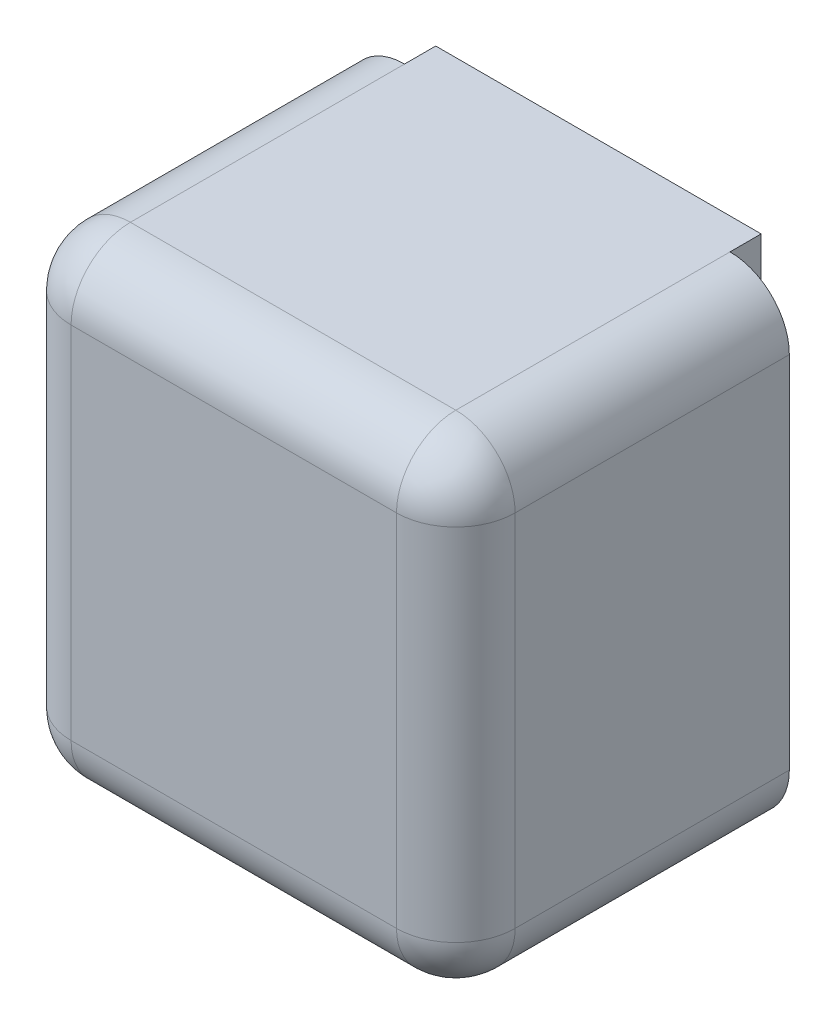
ISO-10303-21;
HEADER;
FILE_DESCRIPTION(('STEP AP214'),'2;1');
FILE_NAME('part.step','',(''),(''),'','','');
FILE_SCHEMA(('AUTOMOTIVE_DESIGN { 1 0 10303 214 1 1 1 1 }'));
ENDSEC;
DATA;
#1=APPLICATION_CONTEXT('core data for automotive mechanical design processes');
#2=APPLICATION_PROTOCOL_DEFINITION('international standard','automotive_design',2000,#1);
#3=PRODUCT_CONTEXT('',#1,'mechanical');
#4=PRODUCT('Part','Part','',(#3));
#5=PRODUCT_RELATED_PRODUCT_CATEGORY('part','',(#4));
#6=PRODUCT_DEFINITION_FORMATION('','',#4);
#7=PRODUCT_DEFINITION_CONTEXT('part definition',#1,'design');
#8=PRODUCT_DEFINITION('design','',#6,#7);
#9=PRODUCT_DEFINITION_SHAPE('','',#8);
#10=(LENGTH_UNIT() NAMED_UNIT(*) SI_UNIT(.MILLI.,.METRE.));
#11=(NAMED_UNIT(*) PLANE_ANGLE_UNIT() SI_UNIT($,.RADIAN.));
#12=(NAMED_UNIT(*) SI_UNIT($,.STERADIAN.) SOLID_ANGLE_UNIT());
#13=UNCERTAINTY_MEASURE_WITH_UNIT(LENGTH_MEASURE(1.E-05),#10,'distance_accuracy_value','');
#14=(GEOMETRIC_REPRESENTATION_CONTEXT(3) GLOBAL_UNCERTAINTY_ASSIGNED_CONTEXT((#13)) GLOBAL_UNIT_ASSIGNED_CONTEXT((#10,
#11,#12)) REPRESENTATION_CONTEXT('',''));
#15=CARTESIAN_POINT('',(0.,0.,0.));
#16=DIRECTION('',(0.,0.,1.));
#17=DIRECTION('',(1.,0.,0.));
#18=AXIS2_PLACEMENT_3D('',#15,#16,#17);
#19=CARTESIAN_POINT('',(-14.2621,-15.367,0.));
#20=DIRECTION('',(0.,0.,1.));
#21=DIRECTION('',(1.,0.,0.));
#22=AXIS2_PLACEMENT_3D('',#19,#20,#21);
#23=PLANE('',#22);
#24=DIRECTION('',(0.,1.,0.));
#25=VECTOR('',#24,1.);
#26=CARTESIAN_POINT('',(-10.4521,-11.049,0.));
#27=LINE('',#26,#25);
#28=CARTESIAN_POINT('',(-10.4521,-15.367,0.));
#29=VERTEX_POINT('',#28);
#30=CARTESIAN_POINT('',(-10.4521,-11.049,0.));
#31=VERTEX_POINT('',#30);
#32=EDGE_CURVE('E142',#29,#31,#27,.T.);
#33=ORIENTED_EDGE('',*,*,#32,.F.);
#34=CARTESIAN_POINT('',(-10.4521,-11.557,0.));
#35=DIRECTION('',(0.,0.,1.));
#36=DIRECTION('',(1.,0.,0.));
#37=AXIS2_PLACEMENT_3D('',#34,#35,#36);
#38=CIRCLE('',#37,3.81);
#39=CARTESIAN_POINT('',(-14.2621,-11.557,0.));
#40=VERTEX_POINT('',#39);
#41=EDGE_CURVE('E155',#29,#40,#38,.F.);
#42=ORIENTED_EDGE('',*,*,#41,.T.);
#43=DIRECTION('',(0.,-1.,0.));
#44=VECTOR('',#43,1.);
#45=CARTESIAN_POINT('',(-14.2621,15.367,0.));
#46=LINE('',#45,#44);
#47=CARTESIAN_POINT('',(-14.2621,11.557,0.));
#48=VERTEX_POINT('',#47);
#49=EDGE_CURVE('E234',#48,#40,#46,.T.);
#50=ORIENTED_EDGE('',*,*,#49,.F.);
#51=CARTESIAN_POINT('',(-10.4521,11.557,0.));
#52=DIRECTION('',(0.,0.,1.));
#53=DIRECTION('',(1.,0.,0.));
#54=AXIS2_PLACEMENT_3D('',#51,#52,#53);
#55=CIRCLE('',#54,3.81);
#56=CARTESIAN_POINT('',(-10.4521,15.367,0.));
#57=VERTEX_POINT('',#56);
#58=EDGE_CURVE('E169',#48,#57,#55,.F.);
#59=ORIENTED_EDGE('',*,*,#58,.T.);
#60=DIRECTION('',(0.,1.,0.));
#61=VECTOR('',#60,1.);
#62=CARTESIAN_POINT('',(-10.4521,15.367,0.));
#63=LINE('',#62,#61);
#64=CARTESIAN_POINT('',(-10.4521,11.049,0.));
#65=VERTEX_POINT('',#64);
#66=EDGE_CURVE('E233',#65,#57,#63,.T.);
#67=ORIENTED_EDGE('',*,*,#66,.F.);
#68=DIRECTION('',(-1.,0.,0.));
#69=VECTOR('',#68,1.);
#70=CARTESIAN_POINT('',(-10.4521,11.049,0.));
#71=LINE('',#70,#69);
#72=CARTESIAN_POINT('',(10.4521,11.049,0.));
#73=VERTEX_POINT('',#72);
#74=EDGE_CURVE('E41',#73,#65,#71,.T.);
#75=ORIENTED_EDGE('',*,*,#74,.F.);
#76=DIRECTION('',(0.,-1.,0.));
#77=VECTOR('',#76,1.);
#78=CARTESIAN_POINT('',(10.4521,11.049,0.));
#79=LINE('',#78,#77);
#80=CARTESIAN_POINT('',(10.4521,15.367,0.));
#81=VERTEX_POINT('',#80);
#82=EDGE_CURVE('E149',#81,#73,#79,.T.);
#83=ORIENTED_EDGE('',*,*,#82,.F.);
#84=CARTESIAN_POINT('',(10.4521,11.557,0.));
#85=DIRECTION('',(0.,0.,1.));
#86=DIRECTION('',(1.,0.,0.));
#87=AXIS2_PLACEMENT_3D('',#84,#85,#86);
#88=CIRCLE('',#87,3.81);
#89=CARTESIAN_POINT('',(14.2621,11.557,0.));
#90=VERTEX_POINT('',#89);
#91=EDGE_CURVE('E47',#81,#90,#88,.F.);
#92=ORIENTED_EDGE('',*,*,#91,.T.);
#93=DIRECTION('',(0.,1.,0.));
#94=VECTOR('',#93,1.);
#95=CARTESIAN_POINT('',(14.2621,15.367,0.));
#96=LINE('',#95,#94);
#97=CARTESIAN_POINT('',(14.2621,-11.557,0.));
#98=VERTEX_POINT('',#97);
#99=EDGE_CURVE('E236',#98,#90,#96,.T.);
#100=ORIENTED_EDGE('',*,*,#99,.F.);
#101=CARTESIAN_POINT('',(10.4521,-11.557,0.));
#102=DIRECTION('',(0.,0.,1.));
#103=DIRECTION('',(1.,0.,0.));
#104=AXIS2_PLACEMENT_3D('',#101,#102,#103);
#105=CIRCLE('',#104,3.81);
#106=CARTESIAN_POINT('',(10.4521,-15.367,0.));
#107=VERTEX_POINT('',#106);
#108=EDGE_CURVE('E176',#98,#107,#105,.F.);
#109=ORIENTED_EDGE('',*,*,#108,.T.);
#110=DIRECTION('',(0.,-1.,0.));
#111=VECTOR('',#110,1.);
#112=CARTESIAN_POINT('',(10.4521,-15.367,0.));
#113=LINE('',#112,#111);
#114=CARTESIAN_POINT('',(10.4521,-11.049,0.));
#115=VERTEX_POINT('',#114);
#116=EDGE_CURVE('E323',#115,#107,#113,.T.);
#117=ORIENTED_EDGE('',*,*,#116,.F.);
#118=DIRECTION('',(1.,0.,0.));
#119=VECTOR('',#118,1.);
#120=CARTESIAN_POINT('',(10.4521,-11.049,0.));
#121=LINE('',#120,#119);
#122=EDGE_CURVE('E158',#31,#115,#121,.T.);
#123=ORIENTED_EDGE('',*,*,#122,.F.);
#124=EDGE_LOOP('',(#33,#42,#50,#59,#67,#75,#83,#92,#100,#109,#117,#123));
#125=FACE_BOUND('',#124,.T.);
#126=ADVANCED_FACE('F26',(#125),#23,.F.);
#127=CARTESIAN_POINT('',(-14.2621,15.367,21.4249));
#128=DIRECTION('',(1.,0.,0.));
#129=DIRECTION('',(0.,0.,-1.));
#130=AXIS2_PLACEMENT_3D('',#127,#128,#129);
#131=PLANE('',#130);
#132=ORIENTED_EDGE('',*,*,#49,.T.);
#133=DIRECTION('',(0.,0.,-1.));
#134=VECTOR('',#133,1.);
#135=CARTESIAN_POINT('',(-14.2621,-11.557,21.4249));
#136=LINE('',#135,#134);
#137=CARTESIAN_POINT('',(-14.2621,-11.557,17.6149));
#138=VERTEX_POINT('',#137);
#139=EDGE_CURVE('E174',#40,#138,#136,.F.);
#140=ORIENTED_EDGE('',*,*,#139,.T.);
#141=DIRECTION('',(0.,-1.,0.));
#142=VECTOR('',#141,1.);
#143=CARTESIAN_POINT('',(-14.2621,15.367,17.6149));
#144=LINE('',#143,#142);
#145=CARTESIAN_POINT('',(-14.2621,11.557,17.6149));
#146=VERTEX_POINT('',#145);
#147=EDGE_CURVE('E258',#138,#146,#144,.F.);
#148=ORIENTED_EDGE('',*,*,#147,.T.);
#149=DIRECTION('',(0.,0.,-1.));
#150=VECTOR('',#149,1.);
#151=CARTESIAN_POINT('',(-14.2621,11.557,21.4249));
#152=LINE('',#151,#150);
#153=EDGE_CURVE('E175',#146,#48,#152,.T.);
#154=ORIENTED_EDGE('',*,*,#153,.T.);
#155=EDGE_LOOP('',(#132,#140,#148,#154));
#156=FACE_BOUND('',#155,.T.);
#157=ADVANCED_FACE('F28',(#156),#131,.F.);
#158=CARTESIAN_POINT('',(-14.2621,-15.367,21.4249));
#159=DIRECTION('',(0.,1.,0.));
#160=DIRECTION('',(0.,0.,1.));
#161=AXIS2_PLACEMENT_3D('',#158,#159,#160);
#162=PLANE('',#161);
#163=DIRECTION('',(1.,0.,0.));
#164=VECTOR('',#163,1.);
#165=CARTESIAN_POINT('',(-14.2621,-15.367,17.6149));
#166=LINE('',#165,#164);
#167=CARTESIAN_POINT('',(10.4521,-15.367,17.6149));
#168=VERTEX_POINT('',#167);
#169=CARTESIAN_POINT('',(-10.4521,-15.367,17.6149));
#170=VERTEX_POINT('',#169);
#171=EDGE_CURVE('E165',#168,#170,#166,.F.);
#172=ORIENTED_EDGE('',*,*,#171,.T.);
#173=DIRECTION('',(0.,0.,-1.));
#174=VECTOR('',#173,1.);
#175=CARTESIAN_POINT('',(-10.4521,-15.367,21.4249));
#176=LINE('',#175,#174);
#177=EDGE_CURVE('E162',#170,#29,#176,.T.);
#178=ORIENTED_EDGE('',*,*,#177,.T.);
#179=DIRECTION('',(0.,0.,1.));
#180=VECTOR('',#179,1.);
#181=CARTESIAN_POINT('',(-10.4521,-15.367,-2.));
#182=LINE('',#181,#180);
#183=CARTESIAN_POINT('',(-10.4521,-15.367,-2.));
#184=VERTEX_POINT('',#183);
#185=EDGE_CURVE('E138',#184,#29,#182,.T.);
#186=ORIENTED_EDGE('',*,*,#185,.F.);
#187=DIRECTION('',(-1.,0.,0.));
#188=VECTOR('',#187,1.);
#189=CARTESIAN_POINT('',(-10.4521,-15.367,-2.));
#190=LINE('',#189,#188);
#191=CARTESIAN_POINT('',(10.4521,-15.367,-2.));
#192=VERTEX_POINT('',#191);
#193=EDGE_CURVE('E503',#192,#184,#190,.T.);
#194=ORIENTED_EDGE('',*,*,#193,.F.);
#195=DIRECTION('',(0.,0.,1.));
#196=VECTOR('',#195,1.);
#197=CARTESIAN_POINT('',(10.4521,-15.367,-2.));
#198=LINE('',#197,#196);
#199=EDGE_CURVE('E325',#192,#107,#198,.T.);
#200=ORIENTED_EDGE('',*,*,#199,.T.);
#201=DIRECTION('',(0.,0.,-1.));
#202=VECTOR('',#201,1.);
#203=CARTESIAN_POINT('',(10.4521,-15.367,21.4249));
#204=LINE('',#203,#202);
#205=EDGE_CURVE('E170',#107,#168,#204,.F.);
#206=ORIENTED_EDGE('',*,*,#205,.T.);
#207=EDGE_LOOP('',(#172,#178,#186,#194,#200,#206));
#208=FACE_BOUND('',#207,.T.);
#209=ADVANCED_FACE('F163',(#208),#162,.F.);
#210=CARTESIAN_POINT('',(14.2621,15.367,21.4249));
#211=DIRECTION('',(-1.,0.,0.));
#212=DIRECTION('',(0.,0.,1.));
#213=AXIS2_PLACEMENT_3D('',#210,#211,#212);
#214=PLANE('',#213);
#215=DIRECTION('',(0.,1.,0.));
#216=VECTOR('',#215,1.);
#217=CARTESIAN_POINT('',(14.2621,-15.367,17.6149));
#218=LINE('',#217,#216);
#219=CARTESIAN_POINT('',(14.2621,11.557,17.6149));
#220=VERTEX_POINT('',#219);
#221=CARTESIAN_POINT('',(14.2621,-11.557,17.6149));
#222=VERTEX_POINT('',#221);
#223=EDGE_CURVE('E211',#220,#222,#218,.F.);
#224=ORIENTED_EDGE('',*,*,#223,.T.);
#225=DIRECTION('',(0.,0.,-1.));
#226=VECTOR('',#225,1.);
#227=CARTESIAN_POINT('',(14.2621,-11.557,21.4249));
#228=LINE('',#227,#226);
#229=EDGE_CURVE('E186',#222,#98,#228,.T.);
#230=ORIENTED_EDGE('',*,*,#229,.T.);
#231=ORIENTED_EDGE('',*,*,#99,.T.);
#232=DIRECTION('',(0.,0.,-1.));
#233=VECTOR('',#232,1.);
#234=CARTESIAN_POINT('',(14.2621,11.557,21.4249));
#235=LINE('',#234,#233);
#236=EDGE_CURVE('E184',#90,#220,#235,.F.);
#237=ORIENTED_EDGE('',*,*,#236,.T.);
#238=EDGE_LOOP('',(#224,#230,#231,#237));
#239=FACE_BOUND('',#238,.T.);
#240=ADVANCED_FACE('F321',(#239),#214,.F.);
#241=CARTESIAN_POINT('',(-14.2621,15.367,21.4249));
#242=DIRECTION('',(0.,-1.,0.));
#243=DIRECTION('',(0.,0.,-1.));
#244=AXIS2_PLACEMENT_3D('',#241,#242,#243);
#245=PLANE('',#244);
#246=DIRECTION('',(-1.,0.,0.));
#247=VECTOR('',#246,1.);
#248=CARTESIAN_POINT('',(14.2621,15.367,17.6149));
#249=LINE('',#248,#247);
#250=CARTESIAN_POINT('',(-10.4521,15.367,17.6149));
#251=VERTEX_POINT('',#250);
#252=CARTESIAN_POINT('',(10.4521,15.367,17.6149));
#253=VERTEX_POINT('',#252);
#254=EDGE_CURVE('E193',#251,#253,#249,.F.);
#255=ORIENTED_EDGE('',*,*,#254,.T.);
#256=DIRECTION('',(0.,0.,-1.));
#257=VECTOR('',#256,1.);
#258=CARTESIAN_POINT('',(10.4521,15.367,21.4249));
#259=LINE('',#258,#257);
#260=EDGE_CURVE('E11',#253,#81,#259,.T.);
#261=ORIENTED_EDGE('',*,*,#260,.T.);
#262=DIRECTION('',(0.,0.,1.));
#263=VECTOR('',#262,1.);
#264=CARTESIAN_POINT('',(10.4521,15.367,-2.));
#265=LINE('',#264,#263);
#266=CARTESIAN_POINT('',(10.4521,15.367,-2.));
#267=VERTEX_POINT('',#266);
#268=EDGE_CURVE('E287',#267,#81,#265,.T.);
#269=ORIENTED_EDGE('',*,*,#268,.F.);
#270=DIRECTION('',(1.,0.,0.));
#271=VECTOR('',#270,1.);
#272=CARTESIAN_POINT('',(10.4521,15.367,-2.));
#273=LINE('',#272,#271);
#274=CARTESIAN_POINT('',(-10.4521,15.367,-2.));
#275=VERTEX_POINT('',#274);
#276=EDGE_CURVE('E289',#275,#267,#273,.T.);
#277=ORIENTED_EDGE('',*,*,#276,.F.);
#278=DIRECTION('',(0.,0.,1.));
#279=VECTOR('',#278,1.);
#280=CARTESIAN_POINT('',(-10.4521,15.367,-2.));
#281=LINE('',#280,#279);
#282=EDGE_CURVE('E196',#275,#57,#281,.T.);
#283=ORIENTED_EDGE('',*,*,#282,.T.);
#284=DIRECTION('',(0.,0.,-1.));
#285=VECTOR('',#284,1.);
#286=CARTESIAN_POINT('',(-10.4521,15.367,21.4249));
#287=LINE('',#286,#285);
#288=EDGE_CURVE('E34',#57,#251,#287,.F.);
#289=ORIENTED_EDGE('',*,*,#288,.T.);
#290=EDGE_LOOP('',(#255,#261,#269,#277,#283,#289));
#291=FACE_BOUND('',#290,.T.);
#292=ADVANCED_FACE('F192',(#291),#245,.F.);
#293=CARTESIAN_POINT('',(-14.2621,-15.367,21.4249));
#294=DIRECTION('',(0.,0.,1.));
#295=DIRECTION('',(1.,0.,0.));
#296=AXIS2_PLACEMENT_3D('',#293,#294,#295);
#297=PLANE('',#296);
#298=DIRECTION('',(0.,1.,0.));
#299=VECTOR('',#298,1.);
#300=CARTESIAN_POINT('',(10.4521,15.367,21.4249));
#301=LINE('',#300,#299);
#302=CARTESIAN_POINT('',(10.4521,-11.557,21.4249));
#303=VERTEX_POINT('',#302);
#304=CARTESIAN_POINT('',(10.4521,11.557,21.4249));
#305=VERTEX_POINT('',#304);
#306=EDGE_CURVE('E250',#303,#305,#301,.T.);
#307=ORIENTED_EDGE('',*,*,#306,.T.);
#308=DIRECTION('',(-1.,0.,0.));
#309=VECTOR('',#308,1.);
#310=CARTESIAN_POINT('',(-14.2621,11.557,21.4249));
#311=LINE('',#310,#309);
#312=CARTESIAN_POINT('',(-10.4521,11.557,21.4249));
#313=VERTEX_POINT('',#312);
#314=EDGE_CURVE('E212',#305,#313,#311,.T.);
#315=ORIENTED_EDGE('',*,*,#314,.T.);
#316=DIRECTION('',(0.,-1.,0.));
#317=VECTOR('',#316,1.);
#318=CARTESIAN_POINT('',(-10.4521,-15.367,21.4249));
#319=LINE('',#318,#317);
#320=CARTESIAN_POINT('',(-10.4521,-11.557,21.4249));
#321=VERTEX_POINT('',#320);
#322=EDGE_CURVE('E239',#313,#321,#319,.T.);
#323=ORIENTED_EDGE('',*,*,#322,.T.);
#324=DIRECTION('',(1.,0.,0.));
#325=VECTOR('',#324,1.);
#326=CARTESIAN_POINT('',(14.2621,-11.557,21.4249));
#327=LINE('',#326,#325);
#328=EDGE_CURVE('E247',#321,#303,#327,.T.);
#329=ORIENTED_EDGE('',*,*,#328,.T.);
#330=EDGE_LOOP('',(#307,#315,#323,#329));
#331=FACE_BOUND('',#330,.T.);
#332=ADVANCED_FACE('F277',(#331),#297,.T.);
#333=CARTESIAN_POINT('',(-14.2621,-11.557,17.6149));
#334=DIRECTION('',(-1.,0.,0.));
#335=DIRECTION('',(0.,0.,1.));
#336=AXIS2_PLACEMENT_3D('',#333,#334,#335);
#337=CYLINDRICAL_SURFACE('',#336,3.81);
#338=ORIENTED_EDGE('',*,*,#328,.F.);
#339=CARTESIAN_POINT('',(-10.4521,-11.557,17.6149));
#340=DIRECTION('',(-1.,0.,0.));
#341=DIRECTION('',(0.,0.,1.));
#342=AXIS2_PLACEMENT_3D('',#339,#340,#341);
#343=CIRCLE('',#342,3.81);
#344=EDGE_CURVE('E267',#321,#170,#343,.F.);
#345=ORIENTED_EDGE('',*,*,#344,.T.);
#346=ORIENTED_EDGE('',*,*,#171,.F.);
#347=CARTESIAN_POINT('',(10.4521,-11.557,17.6149));
#348=DIRECTION('',(-1.,0.,0.));
#349=DIRECTION('',(0.,0.,1.));
#350=AXIS2_PLACEMENT_3D('',#347,#348,#349);
#351=CIRCLE('',#350,3.81);
#352=EDGE_CURVE('E265',#168,#303,#351,.T.);
#353=ORIENTED_EDGE('',*,*,#352,.T.);
#354=EDGE_LOOP('',(#338,#345,#346,#353));
#355=FACE_BOUND('',#354,.T.);
#356=ADVANCED_FACE('F327',(#355),#337,.T.);
#357=CARTESIAN_POINT('',(10.4521,-15.367,17.6149));
#358=DIRECTION('',(0.,-1.,0.));
#359=DIRECTION('',(0.,0.,-1.));
#360=AXIS2_PLACEMENT_3D('',#357,#358,#359);
#361=CYLINDRICAL_SURFACE('',#360,3.81);
#362=ORIENTED_EDGE('',*,*,#306,.F.);
#363=CARTESIAN_POINT('',(10.4521,-11.557,17.6149));
#364=DIRECTION('',(0.,-1.,0.));
#365=DIRECTION('',(0.,0.,-1.));
#366=AXIS2_PLACEMENT_3D('',#363,#364,#365);
#367=CIRCLE('',#366,3.81);
#368=EDGE_CURVE('E224',#303,#222,#367,.F.);
#369=ORIENTED_EDGE('',*,*,#368,.T.);
#370=ORIENTED_EDGE('',*,*,#223,.F.);
#371=CARTESIAN_POINT('',(10.4521,11.557,17.6149));
#372=DIRECTION('',(0.,-1.,0.));
#373=DIRECTION('',(0.,0.,-1.));
#374=AXIS2_PLACEMENT_3D('',#371,#372,#373);
#375=CIRCLE('',#374,3.81);
#376=EDGE_CURVE('E228',#220,#305,#375,.T.);
#377=ORIENTED_EDGE('',*,*,#376,.T.);
#378=EDGE_LOOP('',(#362,#369,#370,#377));
#379=FACE_BOUND('',#378,.T.);
#380=ADVANCED_FACE('F272',(#379),#361,.T.);
#381=CARTESIAN_POINT('',(-10.4521,-15.367,17.6149));
#382=DIRECTION('',(0.,1.,0.));
#383=DIRECTION('',(0.,0.,1.));
#384=AXIS2_PLACEMENT_3D('',#381,#382,#383);
#385=CYLINDRICAL_SURFACE('',#384,3.81);
#386=ORIENTED_EDGE('',*,*,#147,.F.);
#387=CARTESIAN_POINT('',(-10.4521,-11.557,17.6149));
#388=DIRECTION('',(0.,1.,0.));
#389=DIRECTION('',(0.,0.,1.));
#390=AXIS2_PLACEMENT_3D('',#387,#388,#389);
#391=CIRCLE('',#390,3.81);
#392=EDGE_CURVE('E262',#138,#321,#391,.T.);
#393=ORIENTED_EDGE('',*,*,#392,.T.);
#394=ORIENTED_EDGE('',*,*,#322,.F.);
#395=CARTESIAN_POINT('',(-10.4521,11.557,17.6149));
#396=DIRECTION('',(0.,1.,0.));
#397=DIRECTION('',(0.,0.,1.));
#398=AXIS2_PLACEMENT_3D('',#395,#396,#397);
#399=CIRCLE('',#398,3.81);
#400=EDGE_CURVE('E223',#313,#146,#399,.F.);
#401=ORIENTED_EDGE('',*,*,#400,.T.);
#402=EDGE_LOOP('',(#386,#393,#394,#401));
#403=FACE_BOUND('',#402,.T.);
#404=ADVANCED_FACE('F333',(#403),#385,.T.);
#405=CARTESIAN_POINT('',(-14.2621,11.557,17.6149));
#406=DIRECTION('',(1.,0.,0.));
#407=DIRECTION('',(0.,0.,-1.));
#408=AXIS2_PLACEMENT_3D('',#405,#406,#407);
#409=CYLINDRICAL_SURFACE('',#408,3.81);
#410=ORIENTED_EDGE('',*,*,#314,.F.);
#411=CARTESIAN_POINT('',(10.4521,11.557,17.6149));
#412=DIRECTION('',(1.,0.,0.));
#413=DIRECTION('',(0.,0.,-1.));
#414=AXIS2_PLACEMENT_3D('',#411,#412,#413);
#415=CIRCLE('',#414,3.81);
#416=EDGE_CURVE('E210',#305,#253,#415,.F.);
#417=ORIENTED_EDGE('',*,*,#416,.T.);
#418=ORIENTED_EDGE('',*,*,#254,.F.);
#419=CARTESIAN_POINT('',(-10.4521,11.557,17.6149));
#420=DIRECTION('',(1.,0.,0.));
#421=DIRECTION('',(0.,0.,-1.));
#422=AXIS2_PLACEMENT_3D('',#419,#420,#421);
#423=CIRCLE('',#422,3.81);
#424=EDGE_CURVE('E207',#251,#313,#423,.T.);
#425=ORIENTED_EDGE('',*,*,#424,.T.);
#426=EDGE_LOOP('',(#410,#417,#418,#425));
#427=FACE_BOUND('',#426,.T.);
#428=ADVANCED_FACE('F205',(#427),#409,.T.);
#429=CARTESIAN_POINT('',(-10.4521,-11.557,21.4249));
#430=DIRECTION('',(0.,0.,-1.));
#431=DIRECTION('',(-1.,0.,0.));
#432=AXIS2_PLACEMENT_3D('',#429,#430,#431);
#433=CYLINDRICAL_SURFACE('',#432,3.81);
#434=ORIENTED_EDGE('',*,*,#41,.F.);
#435=ORIENTED_EDGE('',*,*,#177,.F.);
#436=CARTESIAN_POINT('',(-10.4521,-11.557,17.6149));
#437=DIRECTION('',(0.,0.,1.));
#438=DIRECTION('',(1.,0.,0.));
#439=AXIS2_PLACEMENT_3D('',#436,#437,#438);
#440=CIRCLE('',#439,3.81);
#441=EDGE_CURVE('E237',#138,#170,#440,.T.);
#442=ORIENTED_EDGE('',*,*,#441,.F.);
#443=ORIENTED_EDGE('',*,*,#139,.F.);
#444=EDGE_LOOP('',(#434,#435,#442,#443));
#445=FACE_BOUND('',#444,.T.);
#446=ADVANCED_FACE('F173',(#445),#433,.T.);
#447=CARTESIAN_POINT('',(-10.4521,-11.557,17.6149));
#448=DIRECTION('',(0.,0.,1.));
#449=DIRECTION('',(1.,0.,0.));
#450=AXIS2_PLACEMENT_3D('',#447,#448,#449);
#451=SPHERICAL_SURFACE('',#450,3.81);
#452=ORIENTED_EDGE('',*,*,#441,.T.);
#453=ORIENTED_EDGE('',*,*,#344,.F.);
#454=ORIENTED_EDGE('',*,*,#392,.F.);
#455=EDGE_LOOP('',(#452,#453,#454));
#456=FACE_BOUND('',#455,.T.);
#457=ADVANCED_FACE('F330',(#456),#451,.T.);
#458=CARTESIAN_POINT('',(10.4521,-11.557,21.4249));
#459=DIRECTION('',(0.,0.,-1.));
#460=DIRECTION('',(-1.,0.,0.));
#461=AXIS2_PLACEMENT_3D('',#458,#459,#460);
#462=CYLINDRICAL_SURFACE('',#461,3.81);
#463=ORIENTED_EDGE('',*,*,#108,.F.);
#464=ORIENTED_EDGE('',*,*,#229,.F.);
#465=CARTESIAN_POINT('',(10.4521,-11.557,17.6149));
#466=DIRECTION('',(0.,0.,1.));
#467=DIRECTION('',(1.,0.,0.));
#468=AXIS2_PLACEMENT_3D('',#465,#466,#467);
#469=CIRCLE('',#468,3.81);
#470=EDGE_CURVE('E241',#168,#222,#469,.T.);
#471=ORIENTED_EDGE('',*,*,#470,.F.);
#472=ORIENTED_EDGE('',*,*,#205,.F.);
#473=EDGE_LOOP('',(#463,#464,#471,#472));
#474=FACE_BOUND('',#473,.T.);
#475=ADVANCED_FACE('F319',(#474),#462,.T.);
#476=CARTESIAN_POINT('',(10.4521,-11.557,17.6149));
#477=DIRECTION('',(0.,0.,1.));
#478=DIRECTION('',(1.,0.,0.));
#479=AXIS2_PLACEMENT_3D('',#476,#477,#478);
#480=SPHERICAL_SURFACE('',#479,3.81);
#481=ORIENTED_EDGE('',*,*,#368,.F.);
#482=ORIENTED_EDGE('',*,*,#352,.F.);
#483=ORIENTED_EDGE('',*,*,#470,.T.);
#484=EDGE_LOOP('',(#481,#482,#483));
#485=FACE_BOUND('',#484,.T.);
#486=ADVANCED_FACE('F315',(#485),#480,.T.);
#487=CARTESIAN_POINT('',(10.4521,11.557,21.4249));
#488=DIRECTION('',(0.,0.,-1.));
#489=DIRECTION('',(-1.,0.,0.));
#490=AXIS2_PLACEMENT_3D('',#487,#488,#489);
#491=CYLINDRICAL_SURFACE('',#490,3.81);
#492=ORIENTED_EDGE('',*,*,#91,.F.);
#493=ORIENTED_EDGE('',*,*,#260,.F.);
#494=CARTESIAN_POINT('',(10.4521,11.557,17.6149));
#495=DIRECTION('',(0.,0.,1.));
#496=DIRECTION('',(1.,0.,0.));
#497=AXIS2_PLACEMENT_3D('',#494,#495,#496);
#498=CIRCLE('',#497,3.81);
#499=EDGE_CURVE('E219',#220,#253,#498,.T.);
#500=ORIENTED_EDGE('',*,*,#499,.F.);
#501=ORIENTED_EDGE('',*,*,#236,.F.);
#502=EDGE_LOOP('',(#492,#493,#500,#501));
#503=FACE_BOUND('',#502,.T.);
#504=ADVANCED_FACE('F284',(#503),#491,.T.);
#505=CARTESIAN_POINT('',(10.4521,11.557,17.6149));
#506=DIRECTION('',(0.,0.,1.));
#507=DIRECTION('',(1.,0.,0.));
#508=AXIS2_PLACEMENT_3D('',#505,#506,#507);
#509=SPHERICAL_SURFACE('',#508,3.81);
#510=ORIENTED_EDGE('',*,*,#416,.F.);
#511=ORIENTED_EDGE('',*,*,#376,.F.);
#512=ORIENTED_EDGE('',*,*,#499,.T.);
#513=EDGE_LOOP('',(#510,#511,#512));
#514=FACE_BOUND('',#513,.T.);
#515=ADVANCED_FACE('F279',(#514),#509,.T.);
#516=CARTESIAN_POINT('',(-10.4521,11.557,21.4249));
#517=DIRECTION('',(0.,0.,-1.));
#518=DIRECTION('',(-1.,0.,0.));
#519=AXIS2_PLACEMENT_3D('',#516,#517,#518);
#520=CYLINDRICAL_SURFACE('',#519,3.81);
#521=ORIENTED_EDGE('',*,*,#58,.F.);
#522=ORIENTED_EDGE('',*,*,#153,.F.);
#523=CARTESIAN_POINT('',(-10.4521,11.557,17.6149));
#524=DIRECTION('',(0.,0.,1.));
#525=DIRECTION('',(1.,0.,0.));
#526=AXIS2_PLACEMENT_3D('',#523,#524,#525);
#527=CIRCLE('',#526,3.81);
#528=EDGE_CURVE('E216',#251,#146,#527,.T.);
#529=ORIENTED_EDGE('',*,*,#528,.F.);
#530=ORIENTED_EDGE('',*,*,#288,.F.);
#531=EDGE_LOOP('',(#521,#522,#529,#530));
#532=FACE_BOUND('',#531,.T.);
#533=ADVANCED_FACE('F217',(#532),#520,.T.);
#534=CARTESIAN_POINT('',(-10.4521,11.557,17.6149));
#535=DIRECTION('',(0.,0.,1.));
#536=DIRECTION('',(1.,0.,0.));
#537=AXIS2_PLACEMENT_3D('',#534,#535,#536);
#538=SPHERICAL_SURFACE('',#537,3.81);
#539=ORIENTED_EDGE('',*,*,#528,.T.);
#540=ORIENTED_EDGE('',*,*,#400,.F.);
#541=ORIENTED_EDGE('',*,*,#424,.F.);
#542=EDGE_LOOP('',(#539,#540,#541));
#543=FACE_BOUND('',#542,.T.);
#544=ADVANCED_FACE('F222',(#543),#538,.T.);
#545=CARTESIAN_POINT('',(10.4521,11.049,-2.));
#546=DIRECTION('',(-1.,0.,0.));
#547=DIRECTION('',(0.,0.,1.));
#548=AXIS2_PLACEMENT_3D('',#545,#546,#547);
#549=PLANE('',#548);
#550=ORIENTED_EDGE('',*,*,#82,.T.);
#551=DIRECTION('',(0.,0.,1.));
#552=VECTOR('',#551,1.);
#553=CARTESIAN_POINT('',(10.4521,11.049,-2.));
#554=LINE('',#553,#552);
#555=CARTESIAN_POINT('',(10.4521,11.049,-2.));
#556=VERTEX_POINT('',#555);
#557=EDGE_CURVE('E220',#556,#73,#554,.T.);
#558=ORIENTED_EDGE('',*,*,#557,.F.);
#559=DIRECTION('',(0.,-1.,0.));
#560=VECTOR('',#559,1.);
#561=CARTESIAN_POINT('',(10.4521,11.049,-2.));
#562=LINE('',#561,#560);
#563=EDGE_CURVE('E295',#267,#556,#562,.T.);
#564=ORIENTED_EDGE('',*,*,#563,.F.);
#565=ORIENTED_EDGE('',*,*,#268,.T.);
#566=EDGE_LOOP('',(#550,#558,#564,#565));
#567=FACE_BOUND('',#566,.T.);
#568=ADVANCED_FACE('F296',(#567),#549,.F.);
#569=CARTESIAN_POINT('',(-10.4521,11.049,-2.));
#570=DIRECTION('',(0.,1.,0.));
#571=DIRECTION('',(0.,0.,1.));
#572=AXIS2_PLACEMENT_3D('',#569,#570,#571);
#573=PLANE('',#572);
#574=ORIENTED_EDGE('',*,*,#74,.T.);
#575=DIRECTION('',(0.,0.,1.));
#576=VECTOR('',#575,1.);
#577=CARTESIAN_POINT('',(-10.4521,11.049,-2.));
#578=LINE('',#577,#576);
#579=CARTESIAN_POINT('',(-10.4521,11.049,-2.));
#580=VERTEX_POINT('',#579);
#581=EDGE_CURVE('E308',#580,#65,#578,.T.);
#582=ORIENTED_EDGE('',*,*,#581,.F.);
#583=DIRECTION('',(-1.,0.,0.));
#584=VECTOR('',#583,1.);
#585=CARTESIAN_POINT('',(-10.4521,11.049,-2.));
#586=LINE('',#585,#584);
#587=EDGE_CURVE('E298',#556,#580,#586,.T.);
#588=ORIENTED_EDGE('',*,*,#587,.F.);
#589=ORIENTED_EDGE('',*,*,#557,.T.);
#590=EDGE_LOOP('',(#574,#582,#588,#589));
#591=FACE_BOUND('',#590,.T.);
#592=ADVANCED_FACE('F433',(#591),#573,.F.);
#593=CARTESIAN_POINT('',(-10.4521,15.367,-2.));
#594=DIRECTION('',(1.,0.,0.));
#595=DIRECTION('',(0.,0.,-1.));
#596=AXIS2_PLACEMENT_3D('',#593,#594,#595);
#597=PLANE('',#596);
#598=ORIENTED_EDGE('',*,*,#66,.T.);
#599=ORIENTED_EDGE('',*,*,#282,.F.);
#600=DIRECTION('',(0.,1.,0.));
#601=VECTOR('',#600,1.);
#602=CARTESIAN_POINT('',(-10.4521,15.367,-2.));
#603=LINE('',#602,#601);
#604=EDGE_CURVE('E300',#580,#275,#603,.T.);
#605=ORIENTED_EDGE('',*,*,#604,.F.);
#606=ORIENTED_EDGE('',*,*,#581,.T.);
#607=EDGE_LOOP('',(#598,#599,#605,#606));
#608=FACE_BOUND('',#607,.T.);
#609=ADVANCED_FACE('F440',(#608),#597,.F.);
#610=CARTESIAN_POINT('',(10.4521,15.367,-2.));
#611=DIRECTION('',(0.,0.,1.));
#612=DIRECTION('',(1.,0.,0.));
#613=AXIS2_PLACEMENT_3D('',#610,#611,#612);
#614=PLANE('',#613);
#615=ORIENTED_EDGE('',*,*,#563,.T.);
#616=ORIENTED_EDGE('',*,*,#587,.T.);
#617=ORIENTED_EDGE('',*,*,#604,.T.);
#618=ORIENTED_EDGE('',*,*,#276,.T.);
#619=EDGE_LOOP('',(#615,#616,#617,#618));
#620=FACE_BOUND('',#619,.T.);
#621=ADVANCED_FACE('F448',(#620),#614,.F.);
#622=CARTESIAN_POINT('',(-10.4521,-11.049,-2.));
#623=DIRECTION('',(1.,0.,0.));
#624=DIRECTION('',(0.,1.,0.));
#625=AXIS2_PLACEMENT_3D('',#622,#623,#624);
#626=PLANE('',#625);
#627=ORIENTED_EDGE('',*,*,#32,.T.);
#628=DIRECTION('',(0.,0.,1.));
#629=VECTOR('',#628,1.);
#630=CARTESIAN_POINT('',(-10.4521,-11.049,-2.));
#631=LINE('',#630,#629);
#632=CARTESIAN_POINT('',(-10.4521,-11.049,-2.));
#633=VERTEX_POINT('',#632);
#634=EDGE_CURVE('E150',#633,#31,#631,.T.);
#635=ORIENTED_EDGE('',*,*,#634,.F.);
#636=DIRECTION('',(0.,1.,0.));
#637=VECTOR('',#636,1.);
#638=CARTESIAN_POINT('',(-10.4521,-11.049,-2.));
#639=LINE('',#638,#637);
#640=EDGE_CURVE('E144',#184,#633,#639,.T.);
#641=ORIENTED_EDGE('',*,*,#640,.F.);
#642=ORIENTED_EDGE('',*,*,#185,.T.);
#643=EDGE_LOOP('',(#627,#635,#641,#642));
#644=FACE_BOUND('',#643,.T.);
#645=ADVANCED_FACE('F140',(#644),#626,.F.);
#646=CARTESIAN_POINT('',(10.4521,-11.049,-2.));
#647=DIRECTION('',(0.,-1.,0.));
#648=DIRECTION('',(0.,0.,-1.));
#649=AXIS2_PLACEMENT_3D('',#646,#647,#648);
#650=PLANE('',#649);
#651=ORIENTED_EDGE('',*,*,#122,.T.);
#652=DIRECTION('',(0.,0.,1.));
#653=VECTOR('',#652,1.);
#654=CARTESIAN_POINT('',(10.4521,-11.049,-2.));
#655=LINE('',#654,#653);
#656=CARTESIAN_POINT('',(10.4521,-11.049,-2.));
#657=VERTEX_POINT('',#656);
#658=EDGE_CURVE('E515',#657,#115,#655,.T.);
#659=ORIENTED_EDGE('',*,*,#658,.F.);
#660=DIRECTION('',(1.,0.,0.));
#661=VECTOR('',#660,1.);
#662=CARTESIAN_POINT('',(10.4521,-11.049,-2.));
#663=LINE('',#662,#661);
#664=EDGE_CURVE('E507',#633,#657,#663,.T.);
#665=ORIENTED_EDGE('',*,*,#664,.F.);
#666=ORIENTED_EDGE('',*,*,#634,.T.);
#667=EDGE_LOOP('',(#651,#659,#665,#666));
#668=FACE_BOUND('',#667,.T.);
#669=ADVANCED_FACE('F462',(#668),#650,.F.);
#670=CARTESIAN_POINT('',(10.4521,-15.367,-2.));
#671=DIRECTION('',(-1.,0.,0.));
#672=DIRECTION('',(0.,0.,1.));
#673=AXIS2_PLACEMENT_3D('',#670,#671,#672);
#674=PLANE('',#673);
#675=ORIENTED_EDGE('',*,*,#116,.T.);
#676=ORIENTED_EDGE('',*,*,#199,.F.);
#677=DIRECTION('',(0.,-1.,0.));
#678=VECTOR('',#677,1.);
#679=CARTESIAN_POINT('',(10.4521,-15.367,-2.));
#680=LINE('',#679,#678);
#681=EDGE_CURVE('E505',#657,#192,#680,.T.);
#682=ORIENTED_EDGE('',*,*,#681,.F.);
#683=ORIENTED_EDGE('',*,*,#658,.T.);
#684=EDGE_LOOP('',(#675,#676,#682,#683));
#685=FACE_BOUND('',#684,.T.);
#686=ADVANCED_FACE('F469',(#685),#674,.F.);
#687=CARTESIAN_POINT('',(10.4521,-15.367,-2.));
#688=DIRECTION('',(0.,0.,1.));
#689=DIRECTION('',(1.,0.,0.));
#690=AXIS2_PLACEMENT_3D('',#687,#688,#689);
#691=PLANE('',#690);
#692=ORIENTED_EDGE('',*,*,#193,.T.);
#693=ORIENTED_EDGE('',*,*,#640,.T.);
#694=ORIENTED_EDGE('',*,*,#664,.T.);
#695=ORIENTED_EDGE('',*,*,#681,.T.);
#696=EDGE_LOOP('',(#692,#693,#694,#695));
#697=FACE_BOUND('',#696,.T.);
#698=ADVANCED_FACE('F477',(#697),#691,.F.);
#699=CLOSED_SHELL('',(#126,#157,#209,#240,#292,#332,#356,#380,#404,#428,#446,#457,#475,#486,
#504,#515,#533,#544,#568,#592,#609,#621,#645,#669,#686,#698));
#700=MANIFOLD_SOLID_BREP('B2',#699);
#701=ADVANCED_BREP_SHAPE_REPRESENTATION('',(#18,#700),#14);
#702=SHAPE_DEFINITION_REPRESENTATION(#9,#701);
ENDSEC;
END-ISO-10303-21;
